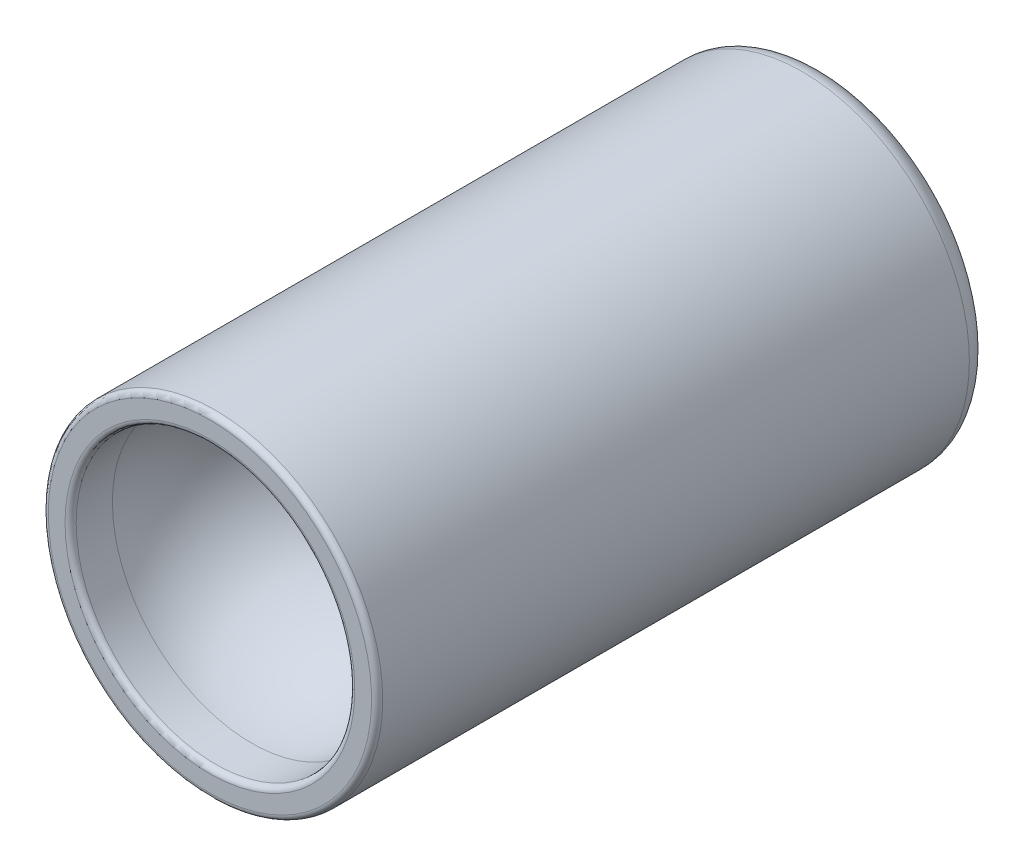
from build123d import *

# Parameters (mm, degrees)
CONG_1_R = 0.2


with BuildPart() as part:
    # Esquisse1 → R_volution1 (revolve)
    with BuildSketch(Plane(origin=(0, 0, 0), x_dir=(0, 0, -1), z_dir=(1, 0, 0)), mode=Mode.PRIVATE) as r_volution1_sk:
        with BuildLine():
            Line((0, 6), (21.25, 6))
            ThreePointArc((21.25, 6), (21.780330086, 5.780330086), (22, 5.25))
            Line((22, 5.25), (22, 5))
            Line((22, 5), (16.5, 5))
            ThreePointArc((16.5, 5), (14.128291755, 4.401704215), (12.324176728, 2.75))
            Line((12.324176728, 2.75), (5.675823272, 2.75))
            ThreePointArc((5.675823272, 2.75), (3.871708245, 4.401704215), (1.5, 5))
            Line((1.5, 5), (0, 5))
            Line((0, 5), (0, 6))
        make_face()
    revolve(r_volution1_sk.sketch.rotate(Axis((0, 0, 0), (0, 0, -1)), 90), axis=Axis((0, 0, 0), (0, 0, -1)))

    # Cong_1
    cong_1_edges = [part.edges().sort_by_distance(p)[0] for p in [
        (-6, 0, 0),
        (-5, 0, -22),
        (-2.75, 0, -12.324176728),
        (-2.75, 0, -5.675823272),
        (-5, 0, 0),
    ]]
    fillet(cong_1_edges, radius=CONG_1_R)


solid = part.part
